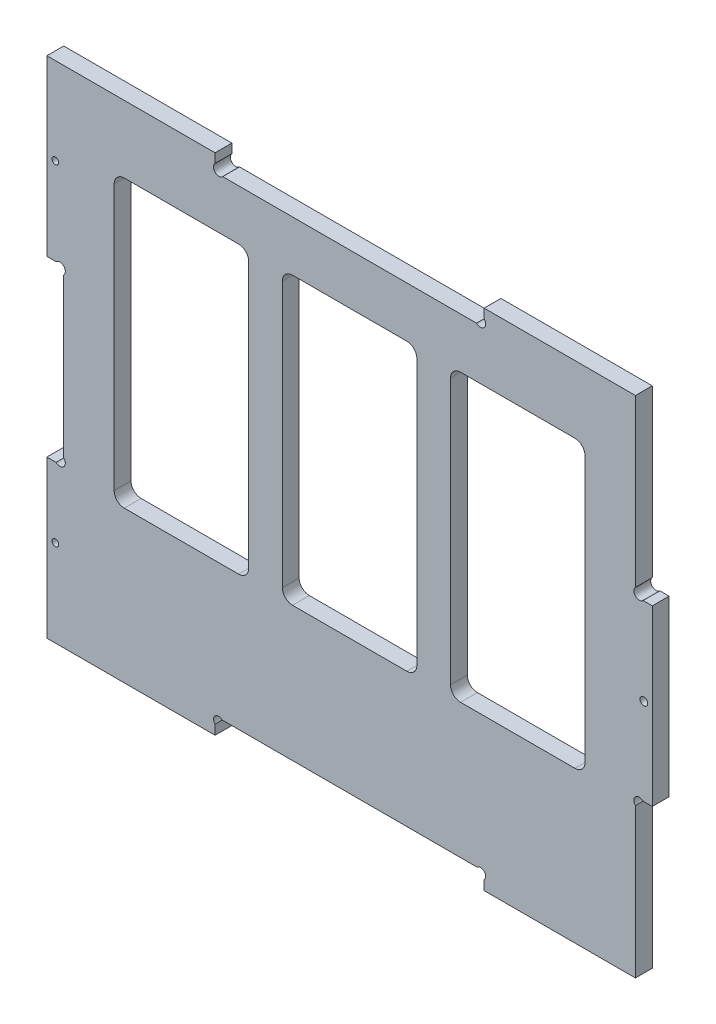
from build123d import *

# Parameters (mm, degrees)
BOSS_EXTRU_1_DEPTH      = 5
ESQUISSE2_W             = 5
ESQUISSE2_H             = 51.666666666
ESQUISSE2_H_2           = 51.666666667
ESQUISSE2_W_2           = 80
ESQUISSE2_H_3           = 5
ENL_V_MAT_EXTRU_1_DEPTH = 232.192560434
ESQUISSE3_R             = 1.6
ENL_V_MAT_EXTRU_2_DEPTH = 232.192560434
ESQUISSE5_R             = 1.15
ENL_V_MAT_EXTRU_3_DEPTH = 232.192560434
ESQUISSE6_R             = 1
ENL_V_MAT_EXTRU_4_DEPTH = 10
ESQUISSE7_W             = 40
ESQUISSE7_H             = 85
ENL_V_MAT_EXTRU_5_DEPTH = 10
CONG_1_R                = 3


with BuildPart() as part:
    # Esquisse1 → Boss.-Extru.1 (new body)
    with BuildSketch(Plane.XY):
        with BuildLine():
            Line((52.121320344, 0), (127.878679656, 0))
            ThreePointArc((127.878679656, 0), (130, 0), (130, -2.121320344))
            Line((130, -2.121320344), (130, -5))
            Line((130, -5), (175, -5))
            Line((175, -5), (175, 0))
            Line((175, 0), (180, 0))
            Line((180, 0), (180, 145))
            Line((180, 145), (0, 145))
            Line((0, 145), (0, 0))
            Line((0, 0), (0, -5))
            Line((0, -5), (50, -5))
            Line((50, -5), (50, -2.121320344))
            ThreePointArc((50, -2.121320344), (50, 0), (52.121320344, 0))
        make_face()
    extrude(amount=BOSS_EXTRU_1_DEPTH)

    # Esquisse2 → Enl_v. mat.-Extru.1 (cut, through all)
    with BuildSketch(Plane.XY.offset(5)):
        with Locations((2.5, 67.5)):
            Rectangle(ESQUISSE2_W, ESQUISSE2_H)
        with Locations((177.5, 119.166666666)):
            Rectangle(ESQUISSE2_W, ESQUISSE2_H_2)
        with Locations((177.5, 15.833333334)):
            Rectangle(ESQUISSE2_W, ESQUISSE2_H_2)
        with Locations((90, 142.5)):
            Rectangle(ESQUISSE2_W_2, ESQUISSE2_H_3)
    extrude(amount=-ENL_V_MAT_EXTRU_1_DEPTH, mode=Mode.SUBTRACT)

    # Esquisse3 → Enl_v. mat.-Extru.2 (cut, through all)
    with BuildSketch(Plane.XY.offset(5)):
        with Locations((51.13137085, 141.13137085)):
            Circle(ESQUISSE3_R)
        with Locations((128.86862915, 141.13137085)):
            Circle(ESQUISSE3_R)
        with Locations((3.86862915, 92.201962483)):
            Circle(ESQUISSE3_R)
        with Locations((3.86862915, 42.798037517)):
            Circle(ESQUISSE3_R)
        with Locations((176.13137085, 94.464704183)):
            Circle(ESQUISSE3_R)
        with Locations((176.13137085, 40.535295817)):
            Circle(ESQUISSE3_R)
    extrude(amount=-ENL_V_MAT_EXTRU_2_DEPTH, mode=Mode.SUBTRACT)

    # Esquisse5 → Enl_v. mat.-Extru.3 (cut, through all)
    with BuildSketch(Plane.XY.offset(5)):
        with Locations((177.5, 67.5)):
            Circle(ESQUISSE5_R)
    extrude(amount=-ENL_V_MAT_EXTRU_3_DEPTH, mode=Mode.SUBTRACT)

    # Esquisse6 → Enl_v. mat.-Extru.4 (cut)
    with BuildSketch(Plane.XY.offset(5)):
        with Locations((2.5, 20.833333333)):
            Circle(ESQUISSE6_R)
        with Locations((2.5, 119.166666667)):
            Circle(ESQUISSE6_R)
    extrude(amount=-ENL_V_MAT_EXTRU_4_DEPTH, mode=Mode.SUBTRACT)

    # Esquisse7 → Enl_v. mat.-Extru.5 (cut)
    with BuildSketch(Plane.XY.offset(5)):
        with Locations((40, 82.5)):
            Rectangle(ESQUISSE7_W, ESQUISSE7_H)
        with Locations((90, 82.5)):
            Rectangle(ESQUISSE7_W, ESQUISSE7_H)
        with Locations((140, 82.5)):
            Rectangle(ESQUISSE7_W, ESQUISSE7_H)
    extrude(amount=-ENL_V_MAT_EXTRU_5_DEPTH, mode=Mode.SUBTRACT)

    # Cong_1
    cong_1_edges = [part.edges().sort_by_distance(p)[0] for p in [
        (60, 125, 2.5),
        (60, 40, 2.5),
        (20, 40, 2.5),
        (20, 125, 2.5),
        (70, 40, 2.5),
        (70, 125, 2.5),
        (110, 125, 2.5),
        (110, 40, 2.5),
        (120, 40, 2.5),
        (120, 125, 2.5),
        (160, 125, 2.5),
        (160, 40, 2.5),
    ]]
    fillet(cong_1_edges, radius=CONG_1_R)


solid = part.part
